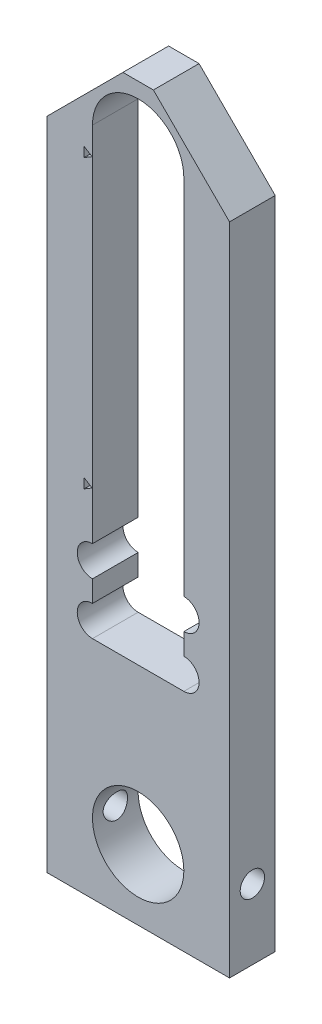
ISO-10303-21;
HEADER;
FILE_DESCRIPTION(('STEP AP214'),'2;1');
FILE_NAME('part.step','',(''),(''),'','','');
FILE_SCHEMA(('AUTOMOTIVE_DESIGN { 1 0 10303 214 1 1 1 1 }'));
ENDSEC;
DATA;
#1=APPLICATION_CONTEXT('core data for automotive mechanical design processes');
#2=APPLICATION_PROTOCOL_DEFINITION('international standard','automotive_design',2000,#1);
#3=PRODUCT_CONTEXT('',#1,'mechanical');
#4=PRODUCT('Part','Part','',(#3));
#5=PRODUCT_RELATED_PRODUCT_CATEGORY('part','',(#4));
#6=PRODUCT_DEFINITION_FORMATION('','',#4);
#7=PRODUCT_DEFINITION_CONTEXT('part definition',#1,'design');
#8=PRODUCT_DEFINITION('design','',#6,#7);
#9=PRODUCT_DEFINITION_SHAPE('','',#8);
#10=(LENGTH_UNIT() NAMED_UNIT(*) SI_UNIT(.MILLI.,.METRE.));
#11=(NAMED_UNIT(*) PLANE_ANGLE_UNIT() SI_UNIT($,.RADIAN.));
#12=(NAMED_UNIT(*) SI_UNIT($,.STERADIAN.) SOLID_ANGLE_UNIT());
#13=UNCERTAINTY_MEASURE_WITH_UNIT(LENGTH_MEASURE(1.E-05),#10,'distance_accuracy_value','');
#14=(GEOMETRIC_REPRESENTATION_CONTEXT(3) GLOBAL_UNCERTAINTY_ASSIGNED_CONTEXT((#13)) GLOBAL_UNIT_ASSIGNED_CONTEXT((#10,
#11,#12)) REPRESENTATION_CONTEXT('',''));
#15=CARTESIAN_POINT('',(0.,0.,0.));
#16=DIRECTION('',(0.,0.,1.));
#17=DIRECTION('',(1.,0.,0.));
#18=AXIS2_PLACEMENT_3D('',#15,#16,#17);
#19=CARTESIAN_POINT('',(0.,0.,15.));
#20=DIRECTION('',(1.,0.,0.));
#21=DIRECTION('',(0.,0.,-1.));
#22=AXIS2_PLACEMENT_3D('',#19,#20,#21);
#23=PLANE('',#22);
#24=CARTESIAN_POINT('',(0.,23.,7.5));
#25=DIRECTION('',(-1.,0.,0.));
#26=DIRECTION('',(0.,0.,1.));
#27=AXIS2_PLACEMENT_3D('',#24,#25,#26);
#28=CIRCLE('',#27,4.);
#29=CARTESIAN_POINT('',(0.,23.,11.5));
#30=VERTEX_POINT('',#29);
#31=EDGE_CURVE('E236',#30,#30,#28,.T.);
#32=ORIENTED_EDGE('',*,*,#31,.F.);
#33=EDGE_LOOP('',(#32));
#34=FACE_BOUND('',#33,.T.);
#35=DIRECTION('',(0.,-1.,0.));
#36=VECTOR('',#35,1.);
#37=CARTESIAN_POINT('',(0.,0.,0.));
#38=LINE('',#37,#36);
#39=CARTESIAN_POINT('',(0.,215.,0.));
#40=VERTEX_POINT('',#39);
#41=CARTESIAN_POINT('',(0.,0.,0.));
#42=VERTEX_POINT('',#41);
#43=EDGE_CURVE('E335',#40,#42,#38,.T.);
#44=ORIENTED_EDGE('',*,*,#43,.T.);
#45=DIRECTION('',(0.,0.,-1.));
#46=VECTOR('',#45,1.);
#47=CARTESIAN_POINT('',(0.,0.,15.));
#48=LINE('',#47,#46);
#49=CARTESIAN_POINT('',(0.,0.,15.));
#50=VERTEX_POINT('',#49);
#51=EDGE_CURVE('E11',#50,#42,#48,.T.);
#52=ORIENTED_EDGE('',*,*,#51,.F.);
#53=DIRECTION('',(0.,-1.,0.));
#54=VECTOR('',#53,1.);
#55=CARTESIAN_POINT('',(0.,0.,15.));
#56=LINE('',#55,#54);
#57=CARTESIAN_POINT('',(0.,215.,15.));
#58=VERTEX_POINT('',#57);
#59=EDGE_CURVE('E348',#58,#50,#56,.T.);
#60=ORIENTED_EDGE('',*,*,#59,.F.);
#61=DIRECTION('',(0.,0.,-1.));
#62=VECTOR('',#61,1.);
#63=CARTESIAN_POINT('',(0.,215.,15.));
#64=LINE('',#63,#62);
#65=EDGE_CURVE('E361',#58,#40,#64,.T.);
#66=ORIENTED_EDGE('',*,*,#65,.T.);
#67=EDGE_LOOP('',(#44,#52,#60,#66));
#68=FACE_BOUND('',#67,.T.);
#69=ADVANCED_FACE('F36',(#34,#68),#23,.F.);
#70=CARTESIAN_POINT('',(0.,0.,15.));
#71=DIRECTION('',(0.,1.,0.));
#72=DIRECTION('',(0.,0.,1.));
#73=AXIS2_PLACEMENT_3D('',#70,#71,#72);
#74=PLANE('',#73);
#75=DIRECTION('',(1.,0.,0.));
#76=VECTOR('',#75,1.);
#77=CARTESIAN_POINT('',(0.,0.,0.));
#78=LINE('',#77,#76);
#79=CARTESIAN_POINT('',(60.,0.,0.));
#80=VERTEX_POINT('',#79);
#81=EDGE_CURVE('E338',#42,#80,#78,.T.);
#82=ORIENTED_EDGE('',*,*,#81,.T.);
#83=DIRECTION('',(0.,0.,-1.));
#84=VECTOR('',#83,1.);
#85=CARTESIAN_POINT('',(60.,0.,15.));
#86=LINE('',#85,#84);
#87=CARTESIAN_POINT('',(60.,0.,15.));
#88=VERTEX_POINT('',#87);
#89=EDGE_CURVE('E48',#88,#80,#86,.T.);
#90=ORIENTED_EDGE('',*,*,#89,.F.);
#91=DIRECTION('',(1.,0.,0.));
#92=VECTOR('',#91,1.);
#93=CARTESIAN_POINT('',(0.,0.,15.));
#94=LINE('',#93,#92);
#95=EDGE_CURVE('E351',#50,#88,#94,.T.);
#96=ORIENTED_EDGE('',*,*,#95,.F.);
#97=ORIENTED_EDGE('',*,*,#51,.T.);
#98=EDGE_LOOP('',(#82,#90,#96,#97));
#99=FACE_BOUND('',#98,.T.);
#100=ADVANCED_FACE('F435',(#99),#74,.F.);
#101=CARTESIAN_POINT('',(60.,0.,15.));
#102=DIRECTION('',(-1.,0.,0.));
#103=DIRECTION('',(0.,0.,1.));
#104=AXIS2_PLACEMENT_3D('',#101,#102,#103);
#105=PLANE('',#104);
#106=CARTESIAN_POINT('',(60.,23.,7.5));
#107=DIRECTION('',(-1.,0.,0.));
#108=DIRECTION('',(0.,0.,1.));
#109=AXIS2_PLACEMENT_3D('',#106,#107,#108);
#110=CIRCLE('',#109,4.);
#111=CARTESIAN_POINT('',(60.,23.,11.5));
#112=VERTEX_POINT('',#111);
#113=EDGE_CURVE('E243',#112,#112,#110,.T.);
#114=ORIENTED_EDGE('',*,*,#113,.T.);
#115=EDGE_LOOP('',(#114));
#116=FACE_BOUND('',#115,.T.);
#117=DIRECTION('',(0.,1.,0.));
#118=VECTOR('',#117,1.);
#119=CARTESIAN_POINT('',(60.,0.,0.));
#120=LINE('',#119,#118);
#121=CARTESIAN_POINT('',(60.,215.,0.));
#122=VERTEX_POINT('',#121);
#123=EDGE_CURVE('E340',#80,#122,#120,.T.);
#124=ORIENTED_EDGE('',*,*,#123,.T.);
#125=DIRECTION('',(0.,0.,-1.));
#126=VECTOR('',#125,1.);
#127=CARTESIAN_POINT('',(60.,215.,15.));
#128=LINE('',#127,#126);
#129=CARTESIAN_POINT('',(60.,215.,15.));
#130=VERTEX_POINT('',#129);
#131=EDGE_CURVE('E370',#130,#122,#128,.T.);
#132=ORIENTED_EDGE('',*,*,#131,.F.);
#133=DIRECTION('',(0.,1.,0.));
#134=VECTOR('',#133,1.);
#135=CARTESIAN_POINT('',(60.,0.,15.));
#136=LINE('',#135,#134);
#137=EDGE_CURVE('E353',#88,#130,#136,.T.);
#138=ORIENTED_EDGE('',*,*,#137,.F.);
#139=ORIENTED_EDGE('',*,*,#89,.T.);
#140=EDGE_LOOP('',(#124,#132,#138,#139));
#141=FACE_BOUND('',#140,.T.);
#142=ADVANCED_FACE('F440',(#116,#141),#105,.F.);
#143=CARTESIAN_POINT('',(35.,240.,15.));
#144=DIRECTION('',(-0.707106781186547,-0.707106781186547,0.));
#145=DIRECTION('',(0.707106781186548,-0.707106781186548,0.));
#146=AXIS2_PLACEMENT_3D('',#143,#144,#145);
#147=PLANE('',#146);
#148=DIRECTION('',(-0.707106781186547,0.707106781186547,0.));
#149=VECTOR('',#148,1.);
#150=CARTESIAN_POINT('',(35.,240.,0.));
#151=LINE('',#150,#149);
#152=CARTESIAN_POINT('',(35.,240.,0.));
#153=VERTEX_POINT('',#152);
#154=EDGE_CURVE('E342',#122,#153,#151,.T.);
#155=ORIENTED_EDGE('',*,*,#154,.T.);
#156=DIRECTION('',(0.,0.,-1.));
#157=VECTOR('',#156,1.);
#158=CARTESIAN_POINT('',(35.,240.,15.));
#159=LINE('',#158,#157);
#160=CARTESIAN_POINT('',(35.,240.,15.));
#161=VERTEX_POINT('',#160);
#162=EDGE_CURVE('E367',#161,#153,#159,.T.);
#163=ORIENTED_EDGE('',*,*,#162,.F.);
#164=DIRECTION('',(-0.707106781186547,0.707106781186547,0.));
#165=VECTOR('',#164,1.);
#166=CARTESIAN_POINT('',(35.,240.,15.));
#167=LINE('',#166,#165);
#168=EDGE_CURVE('E355',#130,#161,#167,.T.);
#169=ORIENTED_EDGE('',*,*,#168,.F.);
#170=ORIENTED_EDGE('',*,*,#131,.T.);
#171=EDGE_LOOP('',(#155,#163,#169,#170));
#172=FACE_BOUND('',#171,.T.);
#173=ADVANCED_FACE('F465',(#172),#147,.F.);
#174=CARTESIAN_POINT('',(25.,240.,15.));
#175=DIRECTION('',(0.,-1.,0.));
#176=DIRECTION('',(0.,0.,-1.));
#177=AXIS2_PLACEMENT_3D('',#174,#175,#176);
#178=PLANE('',#177);
#179=DIRECTION('',(-1.,0.,0.));
#180=VECTOR('',#179,1.);
#181=CARTESIAN_POINT('',(25.,240.,0.));
#182=LINE('',#181,#180);
#183=CARTESIAN_POINT('',(25.,240.,0.));
#184=VERTEX_POINT('',#183);
#185=EDGE_CURVE('E344',#153,#184,#182,.T.);
#186=ORIENTED_EDGE('',*,*,#185,.T.);
#187=DIRECTION('',(0.,0.,-1.));
#188=VECTOR('',#187,1.);
#189=CARTESIAN_POINT('',(25.,240.,15.));
#190=LINE('',#189,#188);
#191=CARTESIAN_POINT('',(25.,240.,15.));
#192=VERTEX_POINT('',#191);
#193=EDGE_CURVE('E364',#192,#184,#190,.T.);
#194=ORIENTED_EDGE('',*,*,#193,.F.);
#195=DIRECTION('',(-1.,0.,0.));
#196=VECTOR('',#195,1.);
#197=CARTESIAN_POINT('',(25.,240.,15.));
#198=LINE('',#197,#196);
#199=EDGE_CURVE('E357',#161,#192,#198,.T.);
#200=ORIENTED_EDGE('',*,*,#199,.F.);
#201=ORIENTED_EDGE('',*,*,#162,.T.);
#202=EDGE_LOOP('',(#186,#194,#200,#201));
#203=FACE_BOUND('',#202,.T.);
#204=ADVANCED_FACE('F462',(#203),#178,.F.);
#205=CARTESIAN_POINT('',(0.,215.,15.));
#206=DIRECTION('',(0.707106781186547,-0.707106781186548,0.));
#207=DIRECTION('',(0.707106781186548,0.707106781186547,0.));
#208=AXIS2_PLACEMENT_3D('',#205,#206,#207);
#209=PLANE('',#208);
#210=DIRECTION('',(-0.707106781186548,-0.707106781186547,0.));
#211=VECTOR('',#210,1.);
#212=CARTESIAN_POINT('',(0.,215.,0.));
#213=LINE('',#212,#211);
#214=EDGE_CURVE('E346',#184,#40,#213,.T.);
#215=ORIENTED_EDGE('',*,*,#214,.T.);
#216=ORIENTED_EDGE('',*,*,#65,.F.);
#217=DIRECTION('',(-0.707106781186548,-0.707106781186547,0.));
#218=VECTOR('',#217,1.);
#219=CARTESIAN_POINT('',(0.,215.,15.));
#220=LINE('',#219,#218);
#221=EDGE_CURVE('E359',#192,#58,#220,.T.);
#222=ORIENTED_EDGE('',*,*,#221,.F.);
#223=ORIENTED_EDGE('',*,*,#193,.T.);
#224=EDGE_LOOP('',(#215,#216,#222,#223));
#225=FACE_BOUND('',#224,.T.);
#226=ADVANCED_FACE('F460',(#225),#209,.F.);
#227=CARTESIAN_POINT('',(0.,240.,15.));
#228=DIRECTION('',(0.,0.,-1.));
#229=DIRECTION('',(-1.,0.,0.));
#230=AXIS2_PLACEMENT_3D('',#227,#228,#229);
#231=PLANE('',#230);
#232=DIRECTION('',(-0.857175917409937,0.515023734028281,0.));
#233=VECTOR('',#232,1.);
#234=CARTESIAN_POINT('',(14.9022186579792,210.987944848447,15.));
#235=LINE('',#234,#233);
#236=CARTESIAN_POINT('',(14.9022186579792,210.987944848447,15.));
#237=VERTEX_POINT('',#236);
#238=CARTESIAN_POINT('',(12.2392705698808,212.587944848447,15.));
#239=VERTEX_POINT('',#238);
#240=EDGE_CURVE('E192',#237,#239,#235,.T.);
#241=ORIENTED_EDGE('',*,*,#240,.F.);
#242=DIRECTION('',(0.857175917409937,0.515023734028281,0.));
#243=VECTOR('',#242,1.);
#244=CARTESIAN_POINT('',(12.2392705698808,209.387944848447,15.));
#245=LINE('',#244,#243);
#246=CARTESIAN_POINT('',(12.2392705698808,209.387944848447,15.));
#247=VERTEX_POINT('',#246);
#248=EDGE_CURVE('E56',#247,#237,#245,.T.);
#249=ORIENTED_EDGE('',*,*,#248,.F.);
#250=DIRECTION('',(0.,-1.,0.));
#251=VECTOR('',#250,1.);
#252=CARTESIAN_POINT('',(12.2392705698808,212.587944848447,15.));
#253=LINE('',#252,#251);
#254=EDGE_CURVE('E202',#239,#247,#253,.T.);
#255=ORIENTED_EDGE('',*,*,#254,.F.);
#256=EDGE_LOOP('',(#241,#249,#255));
#257=FACE_BOUND('',#256,.T.);
#258=DIRECTION('',(-0.857175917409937,0.515023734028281,0.));
#259=VECTOR('',#258,1.);
#260=CARTESIAN_POINT('',(14.9022186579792,116.777944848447,15.));
#261=LINE('',#260,#259);
#262=CARTESIAN_POINT('',(14.9022186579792,116.777944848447,15.));
#263=VERTEX_POINT('',#262);
#264=CARTESIAN_POINT('',(12.2392705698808,118.377944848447,15.));
#265=VERTEX_POINT('',#264);
#266=EDGE_CURVE('E218',#263,#265,#261,.T.);
#267=ORIENTED_EDGE('',*,*,#266,.F.);
#268=DIRECTION('',(0.857175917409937,0.515023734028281,0.));
#269=VECTOR('',#268,1.);
#270=CARTESIAN_POINT('',(12.2392705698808,115.177944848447,15.));
#271=LINE('',#270,#269);
#272=CARTESIAN_POINT('',(12.2392705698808,115.177944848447,15.));
#273=VERTEX_POINT('',#272);
#274=EDGE_CURVE('E216',#273,#263,#271,.T.);
#275=ORIENTED_EDGE('',*,*,#274,.F.);
#276=DIRECTION('',(0.,-1.,0.));
#277=VECTOR('',#276,1.);
#278=CARTESIAN_POINT('',(12.2392705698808,118.377944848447,15.));
#279=LINE('',#278,#277);
#280=EDGE_CURVE('E221',#265,#273,#279,.T.);
#281=ORIENTED_EDGE('',*,*,#280,.F.);
#282=EDGE_LOOP('',(#267,#275,#281));
#283=FACE_BOUND('',#282,.T.);
#284=DIRECTION('',(0.,-1.,0.));
#285=VECTOR('',#284,1.);
#286=CARTESIAN_POINT('',(15.,220.,15.));
#287=LINE('',#286,#285);
#288=CARTESIAN_POINT('',(15.,220.,15.));
#289=VERTEX_POINT('',#288);
#290=CARTESIAN_POINT('',(15.,101.,15.));
#291=VERTEX_POINT('',#290);
#292=EDGE_CURVE('E249',#289,#291,#287,.T.);
#293=ORIENTED_EDGE('',*,*,#292,.F.);
#294=CARTESIAN_POINT('',(30.,220.,15.));
#295=DIRECTION('',(0.,0.,1.));
#296=DIRECTION('',(1.,0.,0.));
#297=AXIS2_PLACEMENT_3D('',#294,#295,#296);
#298=CIRCLE('',#297,15.);
#299=CARTESIAN_POINT('',(45.,220.,15.));
#300=VERTEX_POINT('',#299);
#301=EDGE_CURVE('E247',#300,#289,#298,.T.);
#302=ORIENTED_EDGE('',*,*,#301,.F.);
#303=DIRECTION('',(0.,1.,0.));
#304=VECTOR('',#303,1.);
#305=CARTESIAN_POINT('',(45.,220.,15.));
#306=LINE('',#305,#304);
#307=CARTESIAN_POINT('',(45.,101.,15.));
#308=VERTEX_POINT('',#307);
#309=EDGE_CURVE('E275',#308,#300,#306,.T.);
#310=ORIENTED_EDGE('',*,*,#309,.F.);
#311=CARTESIAN_POINT('',(44.9999999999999,96.,15.));
#312=DIRECTION('',(0.,0.,1.));
#313=DIRECTION('',(1.,0.,0.));
#314=AXIS2_PLACEMENT_3D('',#311,#312,#313);
#315=CIRCLE('',#314,5.);
#316=CARTESIAN_POINT('',(45.,91.,15.));
#317=VERTEX_POINT('',#316);
#318=EDGE_CURVE('E272',#317,#308,#315,.T.);
#319=ORIENTED_EDGE('',*,*,#318,.F.);
#320=DIRECTION('',(0.,1.,0.));
#321=VECTOR('',#320,1.);
#322=CARTESIAN_POINT('',(45.,91.,15.));
#323=LINE('',#322,#321);
#324=CARTESIAN_POINT('',(45.,84.,15.));
#325=VERTEX_POINT('',#324);
#326=EDGE_CURVE('E269',#325,#317,#323,.T.);
#327=ORIENTED_EDGE('',*,*,#326,.F.);
#328=CARTESIAN_POINT('',(45.,79.,15.));
#329=DIRECTION('',(0.,0.,1.));
#330=DIRECTION('',(1.,0.,0.));
#331=AXIS2_PLACEMENT_3D('',#328,#329,#330);
#332=CIRCLE('',#331,5.);
#333=CARTESIAN_POINT('',(45.,74.,15.));
#334=VERTEX_POINT('',#333);
#335=EDGE_CURVE('E266',#334,#325,#332,.T.);
#336=ORIENTED_EDGE('',*,*,#335,.F.);
#337=DIRECTION('',(1.,0.,0.));
#338=VECTOR('',#337,1.);
#339=CARTESIAN_POINT('',(15.,74.,15.));
#340=LINE('',#339,#338);
#341=CARTESIAN_POINT('',(15.,74.,15.));
#342=VERTEX_POINT('',#341);
#343=EDGE_CURVE('E262',#342,#334,#340,.T.);
#344=ORIENTED_EDGE('',*,*,#343,.F.);
#345=CARTESIAN_POINT('',(15.,79.,15.));
#346=DIRECTION('',(0.,0.,1.));
#347=DIRECTION('',(1.,0.,0.));
#348=AXIS2_PLACEMENT_3D('',#345,#346,#347);
#349=CIRCLE('',#348,5.);
#350=CARTESIAN_POINT('',(15.,84.,15.));
#351=VERTEX_POINT('',#350);
#352=EDGE_CURVE('E259',#351,#342,#349,.T.);
#353=ORIENTED_EDGE('',*,*,#352,.F.);
#354=DIRECTION('',(0.,-1.,0.));
#355=VECTOR('',#354,1.);
#356=CARTESIAN_POINT('',(15.,91.,15.));
#357=LINE('',#356,#355);
#358=CARTESIAN_POINT('',(15.,91.,15.));
#359=VERTEX_POINT('',#358);
#360=EDGE_CURVE('E256',#359,#351,#357,.T.);
#361=ORIENTED_EDGE('',*,*,#360,.F.);
#362=CARTESIAN_POINT('',(14.9999999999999,96.,15.));
#363=DIRECTION('',(0.,0.,1.));
#364=DIRECTION('',(1.,0.,0.));
#365=AXIS2_PLACEMENT_3D('',#362,#363,#364);
#366=CIRCLE('',#365,5.);
#367=EDGE_CURVE('E253',#291,#359,#366,.T.);
#368=ORIENTED_EDGE('',*,*,#367,.F.);
#369=EDGE_LOOP('',(#293,#302,#310,#319,#327,#336,#344,#353,#361,#368));
#370=FACE_BOUND('',#369,.T.);
#371=CARTESIAN_POINT('',(30.,23.,15.));
#372=DIRECTION('',(0.,0.,1.));
#373=DIRECTION('',(1.,0.,0.));
#374=AXIS2_PLACEMENT_3D('',#371,#372,#373);
#375=CIRCLE('',#374,15.);
#376=CARTESIAN_POINT('',(45.,23.,15.));
#377=VERTEX_POINT('',#376);
#378=EDGE_CURVE('E311',#377,#377,#375,.T.);
#379=ORIENTED_EDGE('',*,*,#378,.F.);
#380=EDGE_LOOP('',(#379));
#381=FACE_BOUND('',#380,.T.);
#382=ORIENTED_EDGE('',*,*,#59,.T.);
#383=ORIENTED_EDGE('',*,*,#95,.T.);
#384=ORIENTED_EDGE('',*,*,#137,.T.);
#385=ORIENTED_EDGE('',*,*,#168,.T.);
#386=ORIENTED_EDGE('',*,*,#199,.T.);
#387=ORIENTED_EDGE('',*,*,#221,.T.);
#388=EDGE_LOOP('',(#382,#383,#384,#385,#386,#387));
#389=FACE_BOUND('',#388,.T.);
#390=ADVANCED_FACE('F204',(#257,#283,#370,#381,#389),#231,.F.);
#391=CARTESIAN_POINT('',(0.,240.,0.));
#392=DIRECTION('',(0.,0.,-1.));
#393=DIRECTION('',(-1.,0.,0.));
#394=AXIS2_PLACEMENT_3D('',#391,#392,#393);
#395=PLANE('',#394);
#396=DIRECTION('',(0.857175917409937,0.515023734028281,0.));
#397=VECTOR('',#396,1.);
#398=CARTESIAN_POINT('',(12.2392705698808,209.387944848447,0.));
#399=LINE('',#398,#397);
#400=CARTESIAN_POINT('',(12.2392705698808,209.387944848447,0.));
#401=VERTEX_POINT('',#400);
#402=CARTESIAN_POINT('',(14.9022186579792,210.987944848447,0.));
#403=VERTEX_POINT('',#402);
#404=EDGE_CURVE('E213',#401,#403,#399,.T.);
#405=ORIENTED_EDGE('',*,*,#404,.T.);
#406=DIRECTION('',(-0.857175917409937,0.515023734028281,0.));
#407=VECTOR('',#406,1.);
#408=CARTESIAN_POINT('',(14.9022186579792,210.987944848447,0.));
#409=LINE('',#408,#407);
#410=CARTESIAN_POINT('',(12.2392705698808,212.587944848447,0.));
#411=VERTEX_POINT('',#410);
#412=EDGE_CURVE('E199',#403,#411,#409,.T.);
#413=ORIENTED_EDGE('',*,*,#412,.T.);
#414=DIRECTION('',(0.,-1.,0.));
#415=VECTOR('',#414,1.);
#416=CARTESIAN_POINT('',(12.2392705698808,212.587944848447,0.));
#417=LINE('',#416,#415);
#418=EDGE_CURVE('E64',#411,#401,#417,.T.);
#419=ORIENTED_EDGE('',*,*,#418,.T.);
#420=EDGE_LOOP('',(#405,#413,#419));
#421=FACE_BOUND('',#420,.T.);
#422=DIRECTION('',(0.857175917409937,0.515023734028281,0.));
#423=VECTOR('',#422,1.);
#424=CARTESIAN_POINT('',(12.2392705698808,115.177944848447,0.));
#425=LINE('',#424,#423);
#426=CARTESIAN_POINT('',(12.2392705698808,115.177944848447,0.));
#427=VERTEX_POINT('',#426);
#428=CARTESIAN_POINT('',(14.9022186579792,116.777944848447,0.));
#429=VERTEX_POINT('',#428);
#430=EDGE_CURVE('E224',#427,#429,#425,.T.);
#431=ORIENTED_EDGE('',*,*,#430,.T.);
#432=DIRECTION('',(-0.857175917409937,0.515023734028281,0.));
#433=VECTOR('',#432,1.);
#434=CARTESIAN_POINT('',(14.9022186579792,116.777944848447,0.));
#435=LINE('',#434,#433);
#436=CARTESIAN_POINT('',(12.2392705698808,118.377944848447,0.));
#437=VERTEX_POINT('',#436);
#438=EDGE_CURVE('E227',#429,#437,#435,.T.);
#439=ORIENTED_EDGE('',*,*,#438,.T.);
#440=DIRECTION('',(0.,-1.,0.));
#441=VECTOR('',#440,1.);
#442=CARTESIAN_POINT('',(12.2392705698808,118.377944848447,0.));
#443=LINE('',#442,#441);
#444=EDGE_CURVE('E230',#437,#427,#443,.T.);
#445=ORIENTED_EDGE('',*,*,#444,.T.);
#446=EDGE_LOOP('',(#431,#439,#445));
#447=FACE_BOUND('',#446,.T.);
#448=CARTESIAN_POINT('',(30.,220.,0.));
#449=DIRECTION('',(0.,0.,1.));
#450=DIRECTION('',(1.,0.,0.));
#451=AXIS2_PLACEMENT_3D('',#448,#449,#450);
#452=CIRCLE('',#451,15.);
#453=CARTESIAN_POINT('',(45.,220.,0.));
#454=VERTEX_POINT('',#453);
#455=CARTESIAN_POINT('',(15.,220.,0.));
#456=VERTEX_POINT('',#455);
#457=EDGE_CURVE('E278',#454,#456,#452,.T.);
#458=ORIENTED_EDGE('',*,*,#457,.T.);
#459=DIRECTION('',(0.,-1.,0.));
#460=VECTOR('',#459,1.);
#461=CARTESIAN_POINT('',(15.,220.,0.));
#462=LINE('',#461,#460);
#463=CARTESIAN_POINT('',(15.,101.,0.));
#464=VERTEX_POINT('',#463);
#465=EDGE_CURVE('E281',#456,#464,#462,.T.);
#466=ORIENTED_EDGE('',*,*,#465,.T.);
#467=CARTESIAN_POINT('',(14.9999999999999,96.,0.));
#468=DIRECTION('',(0.,0.,1.));
#469=DIRECTION('',(1.,0.,0.));
#470=AXIS2_PLACEMENT_3D('',#467,#468,#469);
#471=CIRCLE('',#470,5.);
#472=CARTESIAN_POINT('',(15.,91.,0.));
#473=VERTEX_POINT('',#472);
#474=EDGE_CURVE('E284',#464,#473,#471,.T.);
#475=ORIENTED_EDGE('',*,*,#474,.T.);
#476=DIRECTION('',(0.,-1.,0.));
#477=VECTOR('',#476,1.);
#478=CARTESIAN_POINT('',(15.,91.,0.));
#479=LINE('',#478,#477);
#480=CARTESIAN_POINT('',(15.,84.,0.));
#481=VERTEX_POINT('',#480);
#482=EDGE_CURVE('E287',#473,#481,#479,.T.);
#483=ORIENTED_EDGE('',*,*,#482,.T.);
#484=CARTESIAN_POINT('',(15.,79.,0.));
#485=DIRECTION('',(0.,0.,1.));
#486=DIRECTION('',(1.,0.,0.));
#487=AXIS2_PLACEMENT_3D('',#484,#485,#486);
#488=CIRCLE('',#487,5.);
#489=CARTESIAN_POINT('',(15.,74.,0.));
#490=VERTEX_POINT('',#489);
#491=EDGE_CURVE('E290',#481,#490,#488,.T.);
#492=ORIENTED_EDGE('',*,*,#491,.T.);
#493=DIRECTION('',(1.,0.,0.));
#494=VECTOR('',#493,1.);
#495=CARTESIAN_POINT('',(15.,74.,0.));
#496=LINE('',#495,#494);
#497=CARTESIAN_POINT('',(45.,74.,0.));
#498=VERTEX_POINT('',#497);
#499=EDGE_CURVE('E293',#490,#498,#496,.T.);
#500=ORIENTED_EDGE('',*,*,#499,.T.);
#501=CARTESIAN_POINT('',(45.,79.,0.));
#502=DIRECTION('',(0.,0.,1.));
#503=DIRECTION('',(1.,0.,0.));
#504=AXIS2_PLACEMENT_3D('',#501,#502,#503);
#505=CIRCLE('',#504,5.);
#506=CARTESIAN_POINT('',(45.,84.,0.));
#507=VERTEX_POINT('',#506);
#508=EDGE_CURVE('E296',#498,#507,#505,.T.);
#509=ORIENTED_EDGE('',*,*,#508,.T.);
#510=DIRECTION('',(0.,1.,0.));
#511=VECTOR('',#510,1.);
#512=CARTESIAN_POINT('',(45.,91.,0.));
#513=LINE('',#512,#511);
#514=CARTESIAN_POINT('',(45.,91.,0.));
#515=VERTEX_POINT('',#514);
#516=EDGE_CURVE('E299',#507,#515,#513,.T.);
#517=ORIENTED_EDGE('',*,*,#516,.T.);
#518=CARTESIAN_POINT('',(44.9999999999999,96.,0.));
#519=DIRECTION('',(0.,0.,1.));
#520=DIRECTION('',(1.,0.,0.));
#521=AXIS2_PLACEMENT_3D('',#518,#519,#520);
#522=CIRCLE('',#521,5.);
#523=CARTESIAN_POINT('',(45.,101.,0.));
#524=VERTEX_POINT('',#523);
#525=EDGE_CURVE('E302',#515,#524,#522,.T.);
#526=ORIENTED_EDGE('',*,*,#525,.T.);
#527=DIRECTION('',(0.,1.,0.));
#528=VECTOR('',#527,1.);
#529=CARTESIAN_POINT('',(45.,220.,0.));
#530=LINE('',#529,#528);
#531=EDGE_CURVE('E305',#524,#454,#530,.T.);
#532=ORIENTED_EDGE('',*,*,#531,.T.);
#533=EDGE_LOOP('',(#458,#466,#475,#483,#492,#500,#509,#517,#526,#532));
#534=FACE_BOUND('',#533,.T.);
#535=CARTESIAN_POINT('',(30.,23.,0.));
#536=DIRECTION('',(0.,0.,1.));
#537=DIRECTION('',(1.,0.,0.));
#538=AXIS2_PLACEMENT_3D('',#535,#536,#537);
#539=CIRCLE('',#538,15.);
#540=CARTESIAN_POINT('',(45.,23.,0.));
#541=VERTEX_POINT('',#540);
#542=EDGE_CURVE('E332',#541,#541,#539,.T.);
#543=ORIENTED_EDGE('',*,*,#542,.T.);
#544=EDGE_LOOP('',(#543));
#545=FACE_BOUND('',#544,.T.);
#546=ORIENTED_EDGE('',*,*,#43,.F.);
#547=ORIENTED_EDGE('',*,*,#214,.F.);
#548=ORIENTED_EDGE('',*,*,#185,.F.);
#549=ORIENTED_EDGE('',*,*,#154,.F.);
#550=ORIENTED_EDGE('',*,*,#123,.F.);
#551=ORIENTED_EDGE('',*,*,#81,.F.);
#552=EDGE_LOOP('',(#546,#547,#548,#549,#550,#551));
#553=FACE_BOUND('',#552,.T.);
#554=ADVANCED_FACE('F432',(#421,#447,#534,#545,#553),#395,.T.);
#555=CARTESIAN_POINT('',(30.,23.,0.));
#556=DIRECTION('',(0.,0.,1.));
#557=DIRECTION('',(1.,0.,0.));
#558=AXIS2_PLACEMENT_3D('',#555,#556,#557);
#559=CYLINDRICAL_SURFACE('',#558,15.);
#560=CARTESIAN_POINT('',(45.,23.,3.5));
#561=CARTESIAN_POINT('',(44.9999966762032,23.2205091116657,3.5000052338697));
#562=CARTESIAN_POINT('',(44.995089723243,23.4410743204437,3.51829522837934));
#563=CARTESIAN_POINT('',(44.9759914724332,23.8758509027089,3.59084246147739));
#564=CARTESIAN_POINT('',(44.9617957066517,24.0900591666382,3.64511700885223));
#565=CARTESIAN_POINT('',(44.9256866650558,24.5057831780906,3.78774333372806));
#566=CARTESIAN_POINT('',(44.9037833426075,24.7073149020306,3.87605117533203));
#567=CARTESIAN_POINT('',(44.8545739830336,25.0927073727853,4.08407448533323));
#568=CARTESIAN_POINT('',(44.8272675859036,25.2765669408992,4.20379204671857));
#569=CARTESIAN_POINT('',(44.7694922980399,25.62565900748,4.47416703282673));
#570=CARTESIAN_POINT('',(44.7389693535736,25.7904233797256,4.62541733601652));
#571=CARTESIAN_POINT('',(44.6785481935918,26.0925742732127,4.9532969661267));
#572=CARTESIAN_POINT('',(44.6486500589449,26.2299572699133,5.12992955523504));
#573=CARTESIAN_POINT('',(44.5923107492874,26.4757281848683,5.50729646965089));
#574=CARTESIAN_POINT('',(44.5659377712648,26.5835775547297,5.70839265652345));
#575=CARTESIAN_POINT('',(44.5204295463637,26.7637509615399,6.12668022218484));
#576=CARTESIAN_POINT('',(44.5012929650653,26.8360815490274,6.34386862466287));
#577=CARTESIAN_POINT('',(44.472982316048,26.9415384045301,6.78299107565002));
#578=CARTESIAN_POINT('',(44.4635929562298,26.9755134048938,7.00470707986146));
#579=CARTESIAN_POINT('',(44.4551966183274,27.0059406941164,7.45087536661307));
#580=CARTESIAN_POINT('',(44.4561877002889,27.0023999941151,7.67532713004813));
#581=CARTESIAN_POINT('',(44.4682475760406,26.958570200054,8.11397083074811));
#582=CARTESIAN_POINT('',(44.4790347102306,26.9193081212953,8.32827436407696));
#583=CARTESIAN_POINT('',(44.5090202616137,26.8067949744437,8.74713666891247));
#584=CARTESIAN_POINT('',(44.5282193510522,26.7335411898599,8.95169466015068));
#585=CARTESIAN_POINT('',(44.5731132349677,26.5542871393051,9.34793628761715));
#586=CARTESIAN_POINT('',(44.598878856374,26.4479268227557,9.53944867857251));
#587=CARTESIAN_POINT('',(44.6539645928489,26.2057300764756,9.90226831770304));
#588=CARTESIAN_POINT('',(44.6832854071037,26.069887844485,10.0735715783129));
#589=CARTESIAN_POINT('',(44.7433502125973,25.7673321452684,10.3969779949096));
#590=CARTESIAN_POINT('',(44.7741094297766,25.599756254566,10.5482726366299));
#591=CARTESIAN_POINT('',(44.8327276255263,25.2412353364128,10.8207775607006));
#592=CARTESIAN_POINT('',(44.8605864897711,25.0502893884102,10.9419866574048));
#593=CARTESIAN_POINT('',(44.9104364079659,24.6491965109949,11.1512358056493));
#594=CARTESIAN_POINT('',(44.9324014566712,24.4389698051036,11.2391295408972));
#595=CARTESIAN_POINT('',(44.96780088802,24.0060045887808,11.3780943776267));
#596=CARTESIAN_POINT('',(44.981237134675,23.7832688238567,11.4291735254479));
#597=CARTESIAN_POINT('',(44.9977831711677,23.338508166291,11.4917897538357));
#598=CARTESIAN_POINT('',(45.0011799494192,23.1166484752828,11.5044260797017));
#599=CARTESIAN_POINT('',(44.9980894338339,22.6739799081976,11.4928336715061));
#600=CARTESIAN_POINT('',(44.9916031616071,22.4531709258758,11.4686087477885));
#601=CARTESIAN_POINT('',(44.9696607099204,22.0227951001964,11.3848831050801));
#602=CARTESIAN_POINT('',(44.9543605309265,21.8131002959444,11.3259955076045));
#603=CARTESIAN_POINT('',(44.9165258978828,21.4065860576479,11.1753281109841));
#604=CARTESIAN_POINT('',(44.8939906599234,21.2097680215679,11.0835447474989));
#605=CARTESIAN_POINT('',(44.8435132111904,20.8303230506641,10.8676522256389));
#606=CARTESIAN_POINT('',(44.8154737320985,20.6480496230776,10.7429450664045));
#607=CARTESIAN_POINT('',(44.7572290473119,20.3066307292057,10.465496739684));
#608=CARTESIAN_POINT('',(44.7270234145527,20.1474898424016,10.3127500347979));
#609=CARTESIAN_POINT('',(44.6667949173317,19.8522215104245,9.97842884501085));
#610=CARTESIAN_POINT('',(44.6368012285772,19.7168696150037,9.79616287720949));
#611=CARTESIAN_POINT('',(44.5813289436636,19.4786561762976,9.41087060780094));
#612=CARTESIAN_POINT('',(44.5558501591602,19.3757932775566,9.20784517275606));
#613=CARTESIAN_POINT('',(44.5125853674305,19.206251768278,8.78780938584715));
#614=CARTESIAN_POINT('',(44.4947549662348,19.1393637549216,8.57088837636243));
#615=CARTESIAN_POINT('',(44.4687965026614,19.0431758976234,8.12832136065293));
#616=CARTESIAN_POINT('',(44.4606659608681,19.0138664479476,7.90267759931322));
#617=CARTESIAN_POINT('',(44.4552348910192,18.9942202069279,7.45701042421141));
#618=CARTESIAN_POINT('',(44.4575879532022,19.0026368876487,7.23704535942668));
#619=CARTESIAN_POINT('',(44.4720479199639,19.0553124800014,6.80179297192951));
#620=CARTESIAN_POINT('',(44.4841545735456,19.0995704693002,6.58650552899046));
#621=CARTESIAN_POINT('',(44.5165514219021,19.2219496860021,6.16828849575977));
#622=CARTESIAN_POINT('',(44.5367777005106,19.2998067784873,5.96527631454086));
#623=CARTESIAN_POINT('',(44.5831363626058,19.4869689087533,5.57504233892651));
#624=CARTESIAN_POINT('',(44.6092696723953,19.5962788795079,5.3878230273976));
#625=CARTESIAN_POINT('',(44.6654584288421,19.8470218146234,5.02853928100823));
#626=CARTESIAN_POINT('',(44.6956066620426,19.9893054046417,4.85708293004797));
#627=CARTESIAN_POINT('',(44.7559100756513,20.3003389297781,4.54007509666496));
#628=CARTESIAN_POINT('',(44.7860652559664,20.4690952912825,4.39452992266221));
#629=CARTESIAN_POINT('',(44.8437562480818,20.8326400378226,4.1304155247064));
#630=CARTESIAN_POINT('',(44.8712222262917,21.0279080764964,4.01248997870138));
#631=CARTESIAN_POINT('',(44.9196762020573,21.4362227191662,3.81132516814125));
#632=CARTESIAN_POINT('',(44.9406683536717,21.6492578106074,3.72806364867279));
#633=CARTESIAN_POINT('',(44.9710950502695,22.051250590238,3.60944942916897));
#634=CARTESIAN_POINT('',(44.9818554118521,22.2384759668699,3.56850123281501));
#635=CARTESIAN_POINT('',(44.9963089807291,22.6171204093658,3.51377558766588));
#636=CARTESIAN_POINT('',(45.0000028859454,22.8085390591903,3.49999545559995));
#637=CARTESIAN_POINT('',(45.,23.,3.5));
#638=B_SPLINE_CURVE_WITH_KNOTS('',3,(#560,#561,#562,#563,#564,#565,#566,#567,#568,#569,#570,
#571,#572,#573,#574,#575,#576,#577,#578,#579,#580,#581,#582,#583,#584,#585,#586,#587,#588,#589,
#590,#591,#592,#593,#594,#595,#596,#597,#598,#599,#600,#601,#602,#603,#604,#605,#606,#607,#608,
#609,#610,#611,#612,#613,#614,#615,#616,#617,#618,#619,#620,#621,#622,#623,#624,#625,#626,#627,
#628,#629,#630,#631,#632,#633,#634,#635,#636,#637),.UNSPECIFIED.,.T.,.F.,(4,2,2,2,2,2,2,2,2,2,2,
2,2,2,2,2,2,2,2,2,2,2,2,2,2,2,2,2,2,2,2,2,2,2,2,2,2,2,4),(0.,0.660825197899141,1.3219684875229,
1.98226110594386,2.6425977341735,3.31669795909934,3.99088489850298,4.67665165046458,
5.362291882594,6.03244316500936,6.7024692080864,7.35382004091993,8.00522293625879,
8.66397346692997,9.3228537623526,10.0032251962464,10.6836234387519,11.3669761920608,
12.0501795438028,12.7136543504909,13.377060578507,14.0290707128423,14.6811515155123,
15.346005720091,16.0109913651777,16.6947299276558,17.3784399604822,18.0581259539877,
18.7376381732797,19.394866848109,20.0520786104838,20.7042153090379,21.3564543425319,
22.0278867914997,22.6994824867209,23.3854450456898,24.0709665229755,24.6447963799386,
25.2185695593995),.UNSPECIFIED.);
#639=CARTESIAN_POINT('',(45.,23.,3.5));
#640=VERTEX_POINT('',#639);
#641=EDGE_CURVE('E39',#640,#640,#638,.T.);
#642=ORIENTED_EDGE('',*,*,#641,.T.);
#643=EDGE_LOOP('',(#642));
#644=FACE_BOUND('',#643,.T.);
#645=CARTESIAN_POINT('',(15.,23.,11.5));
#646=CARTESIAN_POINT('',(15.0000033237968,23.2205091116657,11.4999947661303));
#647=CARTESIAN_POINT('',(15.004910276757,23.4410743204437,11.4817047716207));
#648=CARTESIAN_POINT('',(15.0240085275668,23.8758509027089,11.4091575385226));
#649=CARTESIAN_POINT('',(15.0382042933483,24.0900591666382,11.3548829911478));
#650=CARTESIAN_POINT('',(15.0743133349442,24.5057831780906,11.2122566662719));
#651=CARTESIAN_POINT('',(15.0962166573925,24.7073149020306,11.123948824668));
#652=CARTESIAN_POINT('',(15.1454260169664,25.0927073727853,10.9159255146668));
#653=CARTESIAN_POINT('',(15.1727324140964,25.2765669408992,10.7962079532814));
#654=CARTESIAN_POINT('',(15.2305077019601,25.62565900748,10.5258329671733));
#655=CARTESIAN_POINT('',(15.2610306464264,25.7904233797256,10.3745826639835));
#656=CARTESIAN_POINT('',(15.3214518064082,26.0925742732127,10.0467030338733));
#657=CARTESIAN_POINT('',(15.3513499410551,26.2299572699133,9.87007044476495));
#658=CARTESIAN_POINT('',(15.4076892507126,26.4757281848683,9.49270353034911));
#659=CARTESIAN_POINT('',(15.4340622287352,26.5835775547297,9.29160734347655));
#660=CARTESIAN_POINT('',(15.4795704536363,26.7637509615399,8.87331977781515));
#661=CARTESIAN_POINT('',(15.4987070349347,26.8360815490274,8.65613137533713));
#662=CARTESIAN_POINT('',(15.527017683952,26.9415384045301,8.21700892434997));
#663=CARTESIAN_POINT('',(15.5364070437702,26.9755134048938,7.99529292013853));
#664=CARTESIAN_POINT('',(15.5448033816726,27.0059406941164,7.54912463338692));
#665=CARTESIAN_POINT('',(15.5438122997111,27.0023999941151,7.32467286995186));
#666=CARTESIAN_POINT('',(15.5317524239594,26.958570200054,6.88602916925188));
#667=CARTESIAN_POINT('',(15.5209652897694,26.9193081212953,6.67172563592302));
#668=CARTESIAN_POINT('',(15.4909797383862,26.8067949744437,6.25286333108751));
#669=CARTESIAN_POINT('',(15.4717806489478,26.7335411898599,6.04830533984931));
#670=CARTESIAN_POINT('',(15.4268867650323,26.5542871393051,5.65206371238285));
#671=CARTESIAN_POINT('',(15.4011211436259,26.4479268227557,5.46055132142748));
#672=CARTESIAN_POINT('',(15.3460354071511,26.2057300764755,5.09773168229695));
#673=CARTESIAN_POINT('',(15.3167145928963,26.069887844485,4.92642842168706));
#674=CARTESIAN_POINT('',(15.2566497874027,25.7673321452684,4.6030220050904));
#675=CARTESIAN_POINT('',(15.2258905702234,25.599756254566,4.4517273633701));
#676=CARTESIAN_POINT('',(15.1672723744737,25.2412353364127,4.17922243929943));
#677=CARTESIAN_POINT('',(15.1394135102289,25.0502893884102,4.05801334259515));
#678=CARTESIAN_POINT('',(15.0895635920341,24.6491965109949,3.8487641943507));
#679=CARTESIAN_POINT('',(15.0675985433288,24.4389698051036,3.76087045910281));
#680=CARTESIAN_POINT('',(15.03219911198,24.0060045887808,3.62190562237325));
#681=CARTESIAN_POINT('',(15.018762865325,23.7832688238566,3.57082647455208));
#682=CARTESIAN_POINT('',(15.0022168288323,23.338508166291,3.50821024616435));
#683=CARTESIAN_POINT('',(14.9988200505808,23.1166484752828,3.49557392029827));
#684=CARTESIAN_POINT('',(15.0019105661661,22.6739799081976,3.50716632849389));
#685=CARTESIAN_POINT('',(15.0083968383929,22.4531709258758,3.53139125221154));
#686=CARTESIAN_POINT('',(15.0303392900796,22.0227951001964,3.61511689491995));
#687=CARTESIAN_POINT('',(15.0456394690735,21.8131002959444,3.67400449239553));
#688=CARTESIAN_POINT('',(15.0834741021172,21.4065860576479,3.82467188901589));
#689=CARTESIAN_POINT('',(15.1060093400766,21.2097680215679,3.91645525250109));
#690=CARTESIAN_POINT('',(15.1564867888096,20.8303230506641,4.13234777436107));
#691=CARTESIAN_POINT('',(15.1845262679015,20.6480496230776,4.2570549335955));
#692=CARTESIAN_POINT('',(15.2427709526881,20.3066307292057,4.53450326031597));
#693=CARTESIAN_POINT('',(15.2729765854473,20.1474898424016,4.68724996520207));
#694=CARTESIAN_POINT('',(15.3332050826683,19.8522215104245,5.02157115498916));
#695=CARTESIAN_POINT('',(15.3631987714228,19.7168696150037,5.20383712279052));
#696=CARTESIAN_POINT('',(15.4186710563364,19.4786561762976,5.58912939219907));
#697=CARTESIAN_POINT('',(15.4441498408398,19.3757932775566,5.79215482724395));
#698=CARTESIAN_POINT('',(15.4874146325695,19.2062517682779,6.21219061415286));
#699=CARTESIAN_POINT('',(15.5052450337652,19.1393637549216,6.42911162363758));
#700=CARTESIAN_POINT('',(15.5312034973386,19.0431758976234,6.87167863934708));
#701=CARTESIAN_POINT('',(15.5393340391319,19.0138664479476,7.09732240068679));
#702=CARTESIAN_POINT('',(15.5447651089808,18.9942202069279,7.54298957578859));
#703=CARTESIAN_POINT('',(15.5424120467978,19.0026368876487,7.76295464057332));
#704=CARTESIAN_POINT('',(15.5279520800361,19.0553124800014,8.1982070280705));
#705=CARTESIAN_POINT('',(15.5158454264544,19.0995704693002,8.41349447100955));
#706=CARTESIAN_POINT('',(15.4834485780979,19.2219496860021,8.83171150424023));
#707=CARTESIAN_POINT('',(15.4632222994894,19.2998067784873,9.03472368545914));
#708=CARTESIAN_POINT('',(15.4168636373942,19.4869689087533,9.4249576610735));
#709=CARTESIAN_POINT('',(15.3907303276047,19.596278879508,9.6121769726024));
#710=CARTESIAN_POINT('',(15.3345415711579,19.8470218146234,9.97146071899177));
#711=CARTESIAN_POINT('',(15.3043933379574,19.9893054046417,10.142917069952));
#712=CARTESIAN_POINT('',(15.2440899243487,20.3003389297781,10.459924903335));
#713=CARTESIAN_POINT('',(15.2139347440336,20.4690952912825,10.6054700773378));
#714=CARTESIAN_POINT('',(15.1562437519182,20.8326400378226,10.8695844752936));
#715=CARTESIAN_POINT('',(15.1287777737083,21.0279080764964,10.9875100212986));
#716=CARTESIAN_POINT('',(15.0803237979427,21.4362227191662,11.1886748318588));
#717=CARTESIAN_POINT('',(15.0593316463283,21.6492578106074,11.2719363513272));
#718=CARTESIAN_POINT('',(15.0289049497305,22.051250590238,11.390550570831));
#719=CARTESIAN_POINT('',(15.0181445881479,22.2384759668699,11.431498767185));
#720=CARTESIAN_POINT('',(15.0036910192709,22.6171204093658,11.4862244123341));
#721=CARTESIAN_POINT('',(14.9999971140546,22.8085390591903,11.5000045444));
#722=CARTESIAN_POINT('',(15.,23.,11.5));
#723=B_SPLINE_CURVE_WITH_KNOTS('',3,(#645,#646,#647,#648,#649,#650,#651,#652,#653,#654,#655,
#656,#657,#658,#659,#660,#661,#662,#663,#664,#665,#666,#667,#668,#669,#670,#671,#672,#673,#674,
#675,#676,#677,#678,#679,#680,#681,#682,#683,#684,#685,#686,#687,#688,#689,#690,#691,#692,#693,
#694,#695,#696,#697,#698,#699,#700,#701,#702,#703,#704,#705,#706,#707,#708,#709,#710,#711,#712,
#713,#714,#715,#716,#717,#718,#719,#720,#721,#722),.UNSPECIFIED.,.T.,.F.,(4,2,2,2,2,2,2,2,2,2,2,
2,2,2,2,2,2,2,2,2,2,2,2,2,2,2,2,2,2,2,2,2,2,2,2,2,2,2,4),(0.,0.660825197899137,1.3219684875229,
1.98226110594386,2.6425977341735,3.31669795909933,3.99088489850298,4.67665165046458,
5.36229188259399,6.03244316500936,6.7024692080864,7.35382004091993,8.00522293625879,
8.66397346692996,9.32285376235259,10.0032251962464,10.6836234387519,11.3669761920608,
12.0501795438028,12.7136543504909,13.377060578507,14.0290707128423,14.6811515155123,
15.346005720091,16.0109913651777,16.6947299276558,17.3784399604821,18.0581259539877,
18.7376381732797,19.394866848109,20.0520786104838,20.7042153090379,21.3564543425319,
22.0278867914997,22.6994824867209,23.3854450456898,24.0709665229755,24.6447963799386,
25.2185695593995),.UNSPECIFIED.);
#724=CARTESIAN_POINT('',(15.,23.,11.5));
#725=VERTEX_POINT('',#724);
#726=EDGE_CURVE('E246',#725,#725,#723,.T.);
#727=ORIENTED_EDGE('',*,*,#726,.T.);
#728=EDGE_LOOP('',(#727));
#729=FACE_BOUND('',#728,.T.);
#730=ORIENTED_EDGE('',*,*,#542,.F.);
#731=EDGE_LOOP('',(#730));
#732=FACE_BOUND('',#731,.T.);
#733=ORIENTED_EDGE('',*,*,#378,.T.);
#734=EDGE_LOOP('',(#733));
#735=FACE_BOUND('',#734,.T.);
#736=ADVANCED_FACE('F377',(#644,#729,#732,#735),#559,.F.);
#737=CARTESIAN_POINT('',(30.,220.,0.));
#738=DIRECTION('',(0.,0.,1.));
#739=DIRECTION('',(1.,0.,0.));
#740=AXIS2_PLACEMENT_3D('',#737,#738,#739);
#741=CYLINDRICAL_SURFACE('',#740,15.);
#742=ORIENTED_EDGE('',*,*,#301,.T.);
#743=DIRECTION('',(0.,0.,1.));
#744=VECTOR('',#743,1.);
#745=CARTESIAN_POINT('',(15.,220.,0.));
#746=LINE('',#745,#744);
#747=EDGE_CURVE('E308',#456,#289,#746,.T.);
#748=ORIENTED_EDGE('',*,*,#747,.F.);
#749=ORIENTED_EDGE('',*,*,#457,.F.);
#750=DIRECTION('',(0.,0.,1.));
#751=VECTOR('',#750,1.);
#752=CARTESIAN_POINT('',(45.,220.,0.));
#753=LINE('',#752,#751);
#754=EDGE_CURVE('E309',#454,#300,#753,.T.);
#755=ORIENTED_EDGE('',*,*,#754,.T.);
#756=EDGE_LOOP('',(#742,#748,#749,#755));
#757=FACE_BOUND('',#756,.T.);
#758=ADVANCED_FACE('F395',(#757),#741,.F.);
#759=CARTESIAN_POINT('',(45.,220.,0.));
#760=DIRECTION('',(1.,0.,0.));
#761=DIRECTION('',(0.,1.,0.));
#762=AXIS2_PLACEMENT_3D('',#759,#760,#761);
#763=PLANE('',#762);
#764=ORIENTED_EDGE('',*,*,#309,.T.);
#765=ORIENTED_EDGE('',*,*,#754,.F.);
#766=ORIENTED_EDGE('',*,*,#531,.F.);
#767=DIRECTION('',(0.,0.,1.));
#768=VECTOR('',#767,1.);
#769=CARTESIAN_POINT('',(45.,101.,0.));
#770=LINE('',#769,#768);
#771=EDGE_CURVE('E312',#524,#308,#770,.T.);
#772=ORIENTED_EDGE('',*,*,#771,.T.);
#773=EDGE_LOOP('',(#764,#765,#766,#772));
#774=FACE_BOUND('',#773,.T.);
#775=ADVANCED_FACE('F390',(#774),#763,.F.);
#776=CARTESIAN_POINT('',(44.9999999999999,96.,0.));
#777=DIRECTION('',(0.,0.,1.));
#778=DIRECTION('',(1.,0.,0.));
#779=AXIS2_PLACEMENT_3D('',#776,#777,#778);
#780=CYLINDRICAL_SURFACE('',#779,5.);
#781=ORIENTED_EDGE('',*,*,#318,.T.);
#782=ORIENTED_EDGE('',*,*,#771,.F.);
#783=ORIENTED_EDGE('',*,*,#525,.F.);
#784=DIRECTION('',(0.,0.,1.));
#785=VECTOR('',#784,1.);
#786=CARTESIAN_POINT('',(45.,91.,0.));
#787=LINE('',#786,#785);
#788=EDGE_CURVE('E314',#515,#317,#787,.T.);
#789=ORIENTED_EDGE('',*,*,#788,.T.);
#790=EDGE_LOOP('',(#781,#782,#783,#789));
#791=FACE_BOUND('',#790,.T.);
#792=ADVANCED_FACE('F394',(#791),#780,.F.);
#793=CARTESIAN_POINT('',(45.,91.,0.));
#794=DIRECTION('',(1.,0.,0.));
#795=DIRECTION('',(0.,0.,-1.));
#796=AXIS2_PLACEMENT_3D('',#793,#794,#795);
#797=PLANE('',#796);
#798=ORIENTED_EDGE('',*,*,#326,.T.);
#799=ORIENTED_EDGE('',*,*,#788,.F.);
#800=ORIENTED_EDGE('',*,*,#516,.F.);
#801=DIRECTION('',(0.,0.,1.));
#802=VECTOR('',#801,1.);
#803=CARTESIAN_POINT('',(45.,84.,0.));
#804=LINE('',#803,#802);
#805=EDGE_CURVE('E316',#507,#325,#804,.T.);
#806=ORIENTED_EDGE('',*,*,#805,.T.);
#807=EDGE_LOOP('',(#798,#799,#800,#806));
#808=FACE_BOUND('',#807,.T.);
#809=ADVANCED_FACE('F399',(#808),#797,.F.);
#810=CARTESIAN_POINT('',(45.,79.,0.));
#811=DIRECTION('',(0.,0.,1.));
#812=DIRECTION('',(1.,0.,0.));
#813=AXIS2_PLACEMENT_3D('',#810,#811,#812);
#814=CYLINDRICAL_SURFACE('',#813,5.);
#815=ORIENTED_EDGE('',*,*,#335,.T.);
#816=ORIENTED_EDGE('',*,*,#805,.F.);
#817=ORIENTED_EDGE('',*,*,#508,.F.);
#818=DIRECTION('',(0.,0.,1.));
#819=VECTOR('',#818,1.);
#820=CARTESIAN_POINT('',(45.,74.,0.));
#821=LINE('',#820,#819);
#822=EDGE_CURVE('E318',#498,#334,#821,.T.);
#823=ORIENTED_EDGE('',*,*,#822,.T.);
#824=EDGE_LOOP('',(#815,#816,#817,#823));
#825=FACE_BOUND('',#824,.T.);
#826=ADVANCED_FACE('F403',(#825),#814,.F.);
#827=CARTESIAN_POINT('',(15.,74.,0.));
#828=DIRECTION('',(0.,-1.,0.));
#829=DIRECTION('',(1.,0.,0.));
#830=AXIS2_PLACEMENT_3D('',#827,#828,#829);
#831=PLANE('',#830);
#832=ORIENTED_EDGE('',*,*,#343,.T.);
#833=ORIENTED_EDGE('',*,*,#822,.F.);
#834=ORIENTED_EDGE('',*,*,#499,.F.);
#835=DIRECTION('',(0.,0.,1.));
#836=VECTOR('',#835,1.);
#837=CARTESIAN_POINT('',(15.,74.,0.));
#838=LINE('',#837,#836);
#839=EDGE_CURVE('E320',#490,#342,#838,.T.);
#840=ORIENTED_EDGE('',*,*,#839,.T.);
#841=EDGE_LOOP('',(#832,#833,#834,#840));
#842=FACE_BOUND('',#841,.T.);
#843=ADVANCED_FACE('F407',(#842),#831,.F.);
#844=CARTESIAN_POINT('',(15.,79.,0.));
#845=DIRECTION('',(0.,0.,1.));
#846=DIRECTION('',(1.,0.,0.));
#847=AXIS2_PLACEMENT_3D('',#844,#845,#846);
#848=CYLINDRICAL_SURFACE('',#847,5.);
#849=ORIENTED_EDGE('',*,*,#352,.T.);
#850=ORIENTED_EDGE('',*,*,#839,.F.);
#851=ORIENTED_EDGE('',*,*,#491,.F.);
#852=DIRECTION('',(0.,0.,1.));
#853=VECTOR('',#852,1.);
#854=CARTESIAN_POINT('',(15.,84.,0.));
#855=LINE('',#854,#853);
#856=EDGE_CURVE('E322',#481,#351,#855,.T.);
#857=ORIENTED_EDGE('',*,*,#856,.T.);
#858=EDGE_LOOP('',(#849,#850,#851,#857));
#859=FACE_BOUND('',#858,.T.);
#860=ADVANCED_FACE('F411',(#859),#848,.F.);
#861=CARTESIAN_POINT('',(15.,91.,0.));
#862=DIRECTION('',(-1.,0.,0.));
#863=DIRECTION('',(0.,-1.,0.));
#864=AXIS2_PLACEMENT_3D('',#861,#862,#863);
#865=PLANE('',#864);
#866=ORIENTED_EDGE('',*,*,#360,.T.);
#867=ORIENTED_EDGE('',*,*,#856,.F.);
#868=ORIENTED_EDGE('',*,*,#482,.F.);
#869=DIRECTION('',(0.,0.,1.));
#870=VECTOR('',#869,1.);
#871=CARTESIAN_POINT('',(15.,91.,0.));
#872=LINE('',#871,#870);
#873=EDGE_CURVE('E324',#473,#359,#872,.T.);
#874=ORIENTED_EDGE('',*,*,#873,.T.);
#875=EDGE_LOOP('',(#866,#867,#868,#874));
#876=FACE_BOUND('',#875,.T.);
#877=ADVANCED_FACE('F415',(#876),#865,.F.);
#878=CARTESIAN_POINT('',(14.9999999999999,96.,0.));
#879=DIRECTION('',(0.,0.,1.));
#880=DIRECTION('',(1.,0.,0.));
#881=AXIS2_PLACEMENT_3D('',#878,#879,#880);
#882=CYLINDRICAL_SURFACE('',#881,5.);
#883=ORIENTED_EDGE('',*,*,#367,.T.);
#884=ORIENTED_EDGE('',*,*,#873,.F.);
#885=ORIENTED_EDGE('',*,*,#474,.F.);
#886=DIRECTION('',(0.,0.,1.));
#887=VECTOR('',#886,1.);
#888=CARTESIAN_POINT('',(15.,101.,0.));
#889=LINE('',#888,#887);
#890=EDGE_CURVE('E326',#464,#291,#889,.T.);
#891=ORIENTED_EDGE('',*,*,#890,.T.);
#892=EDGE_LOOP('',(#883,#884,#885,#891));
#893=FACE_BOUND('',#892,.T.);
#894=ADVANCED_FACE('F419',(#893),#882,.F.);
#895=CARTESIAN_POINT('',(15.,220.,0.));
#896=DIRECTION('',(-1.,0.,0.));
#897=DIRECTION('',(0.,-1.,0.));
#898=AXIS2_PLACEMENT_3D('',#895,#896,#897);
#899=PLANE('',#898);
#900=ORIENTED_EDGE('',*,*,#292,.T.);
#901=ORIENTED_EDGE('',*,*,#890,.F.);
#902=ORIENTED_EDGE('',*,*,#465,.F.);
#903=ORIENTED_EDGE('',*,*,#747,.T.);
#904=EDGE_LOOP('',(#900,#901,#902,#903));
#905=FACE_BOUND('',#904,.T.);
#906=ADVANCED_FACE('F423',(#905),#899,.F.);
#907=CARTESIAN_POINT('',(60.,23.,7.5));
#908=DIRECTION('',(-1.,0.,0.));
#909=DIRECTION('',(0.,0.,1.));
#910=AXIS2_PLACEMENT_3D('',#907,#908,#909);
#911=CYLINDRICAL_SURFACE('',#910,4.);
#912=ORIENTED_EDGE('',*,*,#31,.T.);
#913=EDGE_LOOP('',(#912));
#914=FACE_BOUND('',#913,.T.);
#915=ORIENTED_EDGE('',*,*,#726,.F.);
#916=EDGE_LOOP('',(#915));
#917=FACE_BOUND('',#916,.T.);
#918=ADVANCED_FACE('F387',(#914,#917),#911,.F.);
#919=ORIENTED_EDGE('',*,*,#113,.F.);
#920=EDGE_LOOP('',(#919));
#921=FACE_BOUND('',#920,.T.);
#922=ORIENTED_EDGE('',*,*,#641,.F.);
#923=EDGE_LOOP('',(#922));
#924=FACE_BOUND('',#923,.T.);
#925=ADVANCED_FACE('F381',(#921,#924),#911,.F.);
#926=CARTESIAN_POINT('',(12.2392705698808,115.177944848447,0.));
#927=DIRECTION('',(0.515023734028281,-0.857175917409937,0.));
#928=DIRECTION('',(0.857175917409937,0.515023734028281,0.));
#929=AXIS2_PLACEMENT_3D('',#926,#927,#928);
#930=PLANE('',#929);
#931=ORIENTED_EDGE('',*,*,#274,.T.);
#932=DIRECTION('',(0.,0.,1.));
#933=VECTOR('',#932,1.);
#934=CARTESIAN_POINT('',(14.9022186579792,116.777944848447,0.));
#935=LINE('',#934,#933);
#936=EDGE_CURVE('E233',#429,#263,#935,.T.);
#937=ORIENTED_EDGE('',*,*,#936,.F.);
#938=ORIENTED_EDGE('',*,*,#430,.F.);
#939=DIRECTION('',(0.,0.,1.));
#940=VECTOR('',#939,1.);
#941=CARTESIAN_POINT('',(12.2392705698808,115.177944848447,0.));
#942=LINE('',#941,#940);
#943=EDGE_CURVE('E234',#427,#273,#942,.T.);
#944=ORIENTED_EDGE('',*,*,#943,.T.);
#945=EDGE_LOOP('',(#931,#937,#938,#944));
#946=FACE_BOUND('',#945,.T.);
#947=ADVANCED_FACE('F386',(#946),#930,.F.);
#948=CARTESIAN_POINT('',(12.2392705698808,118.377944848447,0.));
#949=DIRECTION('',(-1.,0.,0.));
#950=DIRECTION('',(0.,0.,1.));
#951=AXIS2_PLACEMENT_3D('',#948,#949,#950);
#952=PLANE('',#951);
#953=ORIENTED_EDGE('',*,*,#280,.T.);
#954=ORIENTED_EDGE('',*,*,#943,.F.);
#955=ORIENTED_EDGE('',*,*,#444,.F.);
#956=DIRECTION('',(0.,0.,1.));
#957=VECTOR('',#956,1.);
#958=CARTESIAN_POINT('',(12.2392705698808,118.377944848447,0.));
#959=LINE('',#958,#957);
#960=EDGE_CURVE('E237',#437,#265,#959,.T.);
#961=ORIENTED_EDGE('',*,*,#960,.T.);
#962=EDGE_LOOP('',(#953,#954,#955,#961));
#963=FACE_BOUND('',#962,.T.);
#964=ADVANCED_FACE('F526',(#963),#952,.F.);
#965=CARTESIAN_POINT('',(14.9022186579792,116.777944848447,0.));
#966=DIRECTION('',(0.515023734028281,0.857175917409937,0.));
#967=DIRECTION('',(-0.857175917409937,0.515023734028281,0.));
#968=AXIS2_PLACEMENT_3D('',#965,#966,#967);
#969=PLANE('',#968);
#970=ORIENTED_EDGE('',*,*,#266,.T.);
#971=ORIENTED_EDGE('',*,*,#960,.F.);
#972=ORIENTED_EDGE('',*,*,#438,.F.);
#973=ORIENTED_EDGE('',*,*,#936,.T.);
#974=EDGE_LOOP('',(#970,#971,#972,#973));
#975=FACE_BOUND('',#974,.T.);
#976=ADVANCED_FACE('F523',(#975),#969,.F.);
#977=CARTESIAN_POINT('',(12.2392705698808,209.387944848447,0.));
#978=DIRECTION('',(0.515023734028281,-0.857175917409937,0.));
#979=DIRECTION('',(0.857175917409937,0.515023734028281,0.));
#980=AXIS2_PLACEMENT_3D('',#977,#978,#979);
#981=PLANE('',#980);
#982=ORIENTED_EDGE('',*,*,#248,.T.);
#983=DIRECTION('',(0.,0.,1.));
#984=VECTOR('',#983,1.);
#985=CARTESIAN_POINT('',(14.9022186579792,210.987944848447,0.));
#986=LINE('',#985,#984);
#987=EDGE_CURVE('E196',#403,#237,#986,.T.);
#988=ORIENTED_EDGE('',*,*,#987,.F.);
#989=ORIENTED_EDGE('',*,*,#404,.F.);
#990=DIRECTION('',(0.,0.,1.));
#991=VECTOR('',#990,1.);
#992=CARTESIAN_POINT('',(12.2392705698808,209.387944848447,0.));
#993=LINE('',#992,#991);
#994=EDGE_CURVE('E206',#401,#247,#993,.T.);
#995=ORIENTED_EDGE('',*,*,#994,.T.);
#996=EDGE_LOOP('',(#982,#988,#989,#995));
#997=FACE_BOUND('',#996,.T.);
#998=ADVANCED_FACE('F533',(#997),#981,.F.);
#999=CARTESIAN_POINT('',(12.2392705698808,212.587944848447,0.));
#1000=DIRECTION('',(-1.,0.,0.));
#1001=DIRECTION('',(0.,0.,1.));
#1002=AXIS2_PLACEMENT_3D('',#999,#1000,#1001);
#1003=PLANE('',#1002);
#1004=ORIENTED_EDGE('',*,*,#254,.T.);
#1005=ORIENTED_EDGE('',*,*,#994,.F.);
#1006=ORIENTED_EDGE('',*,*,#418,.F.);
#1007=DIRECTION('',(0.,0.,1.));
#1008=VECTOR('',#1007,1.);
#1009=CARTESIAN_POINT('',(12.2392705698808,212.587944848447,0.));
#1010=LINE('',#1009,#1008);
#1011=EDGE_CURVE('E194',#411,#239,#1010,.T.);
#1012=ORIENTED_EDGE('',*,*,#1011,.T.);
#1013=EDGE_LOOP('',(#1004,#1005,#1006,#1012));
#1014=FACE_BOUND('',#1013,.T.);
#1015=ADVANCED_FACE('F201',(#1014),#1003,.F.);
#1016=CARTESIAN_POINT('',(14.9022186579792,210.987944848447,0.));
#1017=DIRECTION('',(0.515023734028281,0.857175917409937,0.));
#1018=DIRECTION('',(-0.857175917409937,0.515023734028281,0.));
#1019=AXIS2_PLACEMENT_3D('',#1016,#1017,#1018);
#1020=PLANE('',#1019);
#1021=ORIENTED_EDGE('',*,*,#240,.T.);
#1022=ORIENTED_EDGE('',*,*,#1011,.F.);
#1023=ORIENTED_EDGE('',*,*,#412,.F.);
#1024=ORIENTED_EDGE('',*,*,#987,.T.);
#1025=EDGE_LOOP('',(#1021,#1022,#1023,#1024));
#1026=FACE_BOUND('',#1025,.T.);
#1027=ADVANCED_FACE('F193',(#1026),#1020,.F.);
#1028=CLOSED_SHELL('',(#69,#100,#142,#173,#204,#226,#390,#554,#736,#758,#775,#792,#809,#826,
#843,#860,#877,#894,#906,#918,#925,#947,#964,#976,#998,#1015,#1027));
#1029=MANIFOLD_SOLID_BREP('B2',#1028);
#1030=ADVANCED_BREP_SHAPE_REPRESENTATION('',(#18,#1029),#14);
#1031=SHAPE_DEFINITION_REPRESENTATION(#9,#1030);
ENDSEC;
END-ISO-10303-21;
